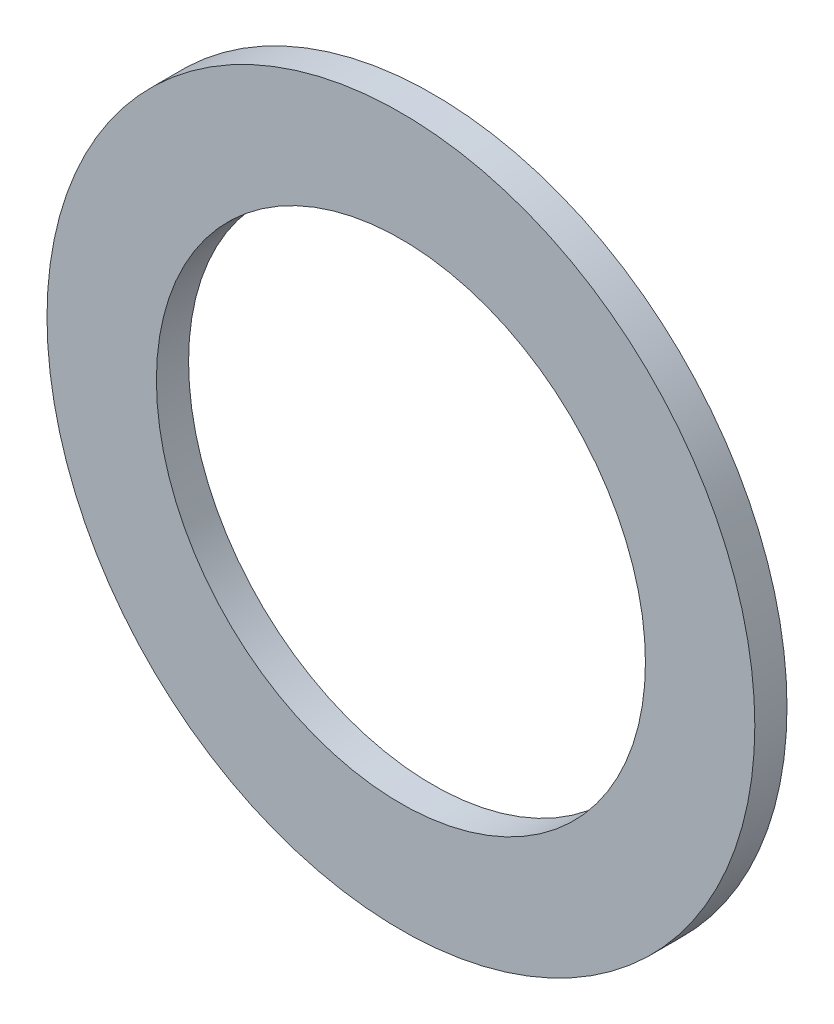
from build123d import *

# Parameters (mm, degrees)
ESQUISSE1_R      = 55
ESQUISSE1_R_2    = 38
EXTRUSION1_DEPTH = 5


with BuildPart() as part:
    # Esquisse1 → Extrusion1 (new body)
    with BuildSketch(Plane.XY):
        Circle(ESQUISSE1_R)
        Circle(ESQUISSE1_R_2, mode=Mode.SUBTRACT)
    extrude(amount=EXTRUSION1_DEPTH)


solid = part.part
